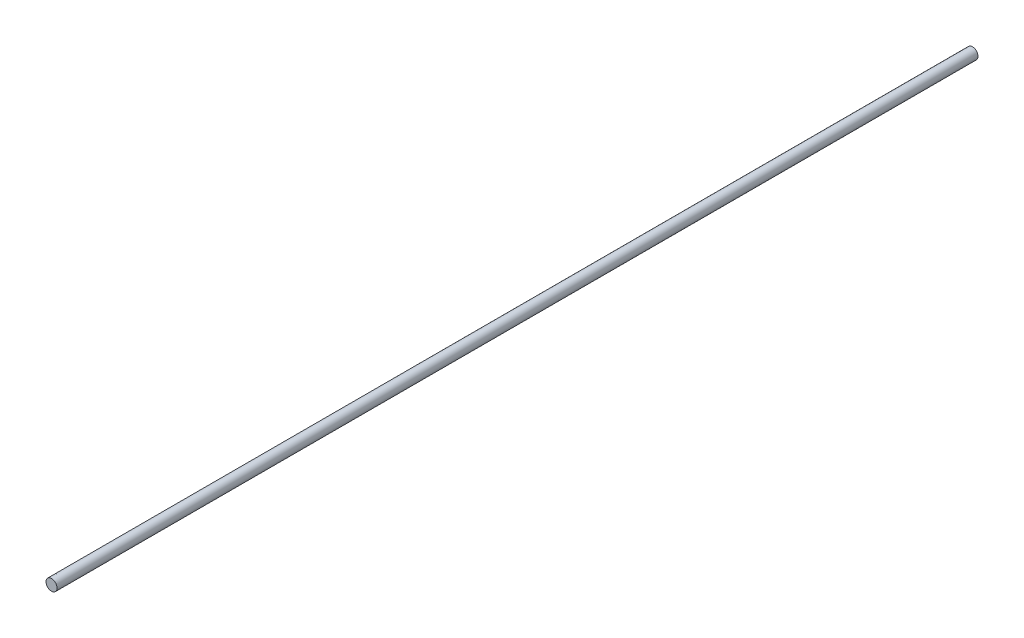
from build123d import *

# Parameters (mm, degrees)
ESQUISSE1_R        = 1.5
BOSS_EXTRU_1_DEPTH = 250


with BuildPart() as part:
    # Esquisse1 → Boss.-Extru.1 (new body)
    with BuildSketch(Plane.XY):
        Circle(ESQUISSE1_R)
    extrude(amount=BOSS_EXTRU_1_DEPTH)


solid = part.part
